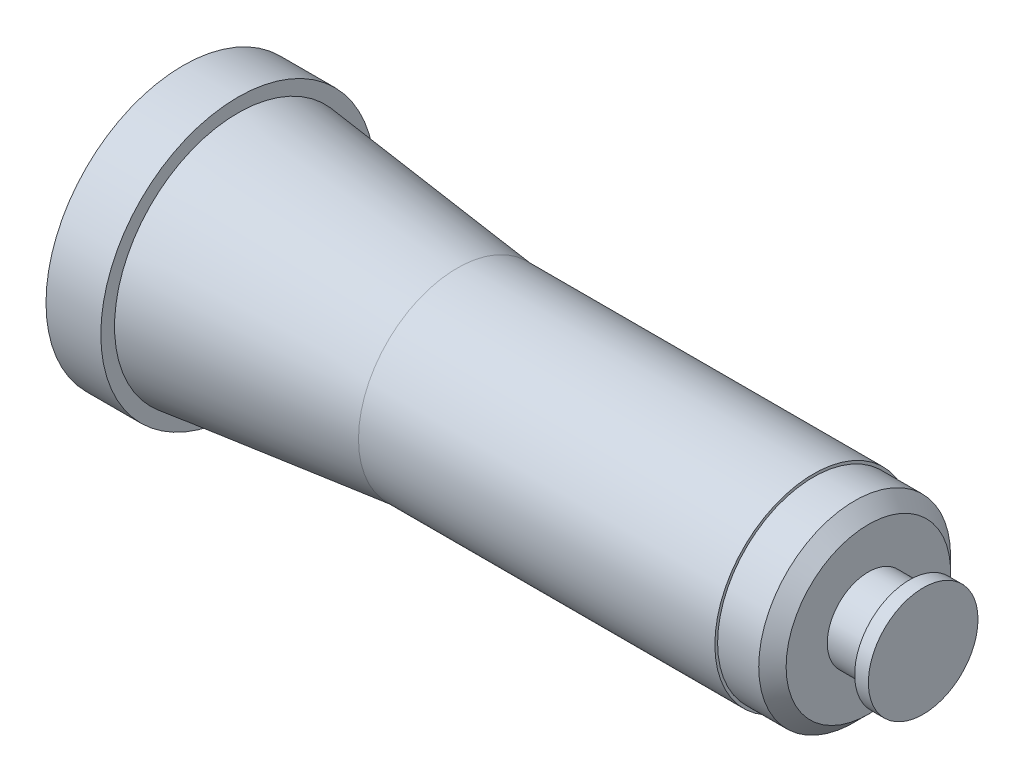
from build123d import *

# Parameters (mm, degrees)
CHANFREIN1_SIZE = 0.5


with BuildPart() as part:
    # Esquisse1 → Base-R_volution (revolve)
    with BuildSketch(Plane.XY, mode=Mode.PRIVATE) as base_r_volution_sk:
        with BuildLine():
            Line((0, 0), (0, -2))
            Line((0, -2), (-0.5, -2))
            Line((-0.5, -2), (-0.5, -1.5))
            Line((-0.5, -1.5), (-2, -1.5))
            Line((-2, -1.5), (-2, -3.5))
            Line((-2, -3.5), (-4, -3.5))
            Line((-4, -3.5), (-4, -3.6))
            Line((-4, -3.6), (-17, -3.6))
            Line((-17, -3.6), (-25, -4.5))
            Line((-25, -4.5), (-25, -5))
            Line((-25, -5), (-27, -5))
            Line((-27, -5), (-27, -3.5))
            Line((-27, -3.5), (-17.706462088, -2.467384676))
            ThreePointArc((-17.706462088, -2.467384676), (-15.342198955, -2.926994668), (-13.401923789, -1.5))
            Line((-13.401923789, -1.5), (-4, -1.5))
            Line((-4, -1.5), (-4, 0))
            Line((-4, 0), (0, 0))
        make_face()
    revolve(base_r_volution_sk.sketch.rotate(Axis((0, 0, 0), (-1, 0, 0)), 270), axis=Axis((0, 0, 0), (-1, 0, 0)))

    # Chanfrein1
    chanfrein1_edges = [part.edges().sort_by_distance(p)[0] for p in [
        (-2, 0, 3.5),
    ]]
    chamfer(chanfrein1_edges, length=CHANFREIN1_SIZE)


solid = part.part
